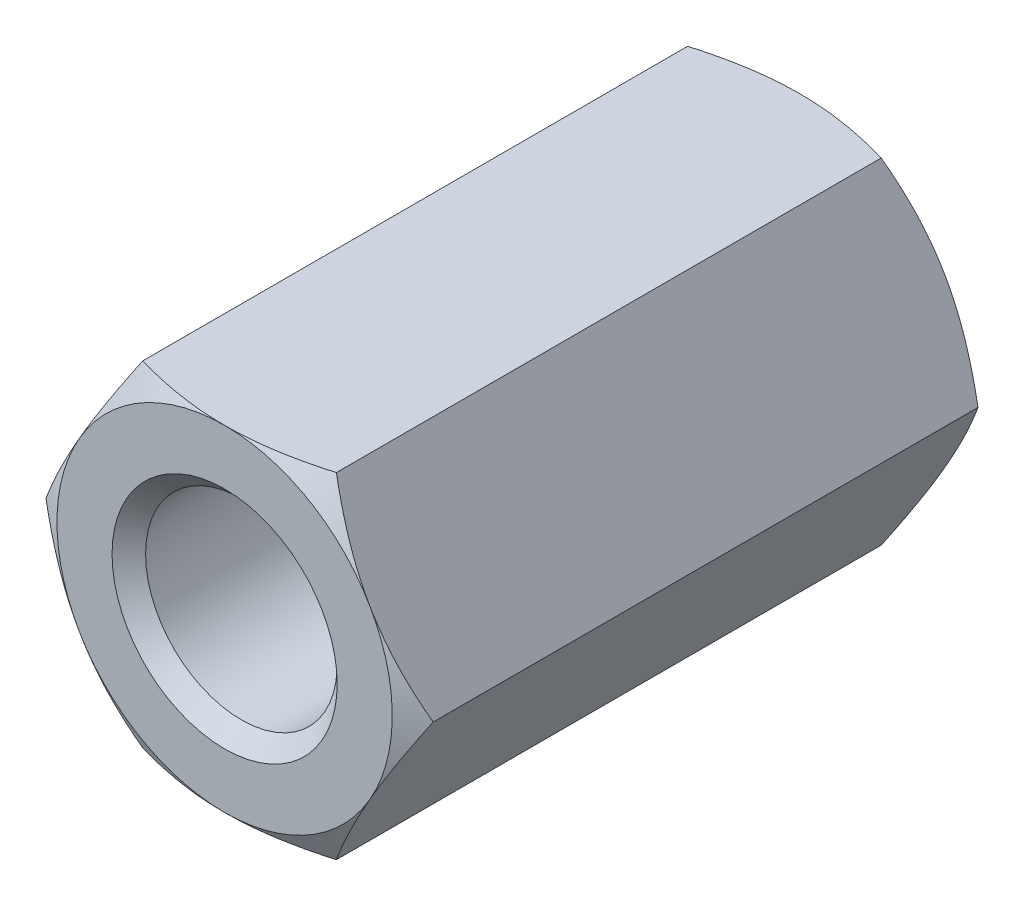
from build123d import *

# Parameters (mm, degrees)
BOSS_EXTRUDE1_DEPTH      = 6
SKETCH2_OUTSIDE_W        = 43.838
SKETCH2_OUTSIDE_H        = 42.756
SKETCH2_OUTSIDE_R        = 3.5
CUT_EXTRUDE1_DEPTH       = 9.036375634
CUT_EXTRUDE1_DRAFT       = -60
SKETCH3_R                = 2
SKETCH3_R_2              = 1.65
CUT_EXTRUDE2_DEPTH       = 6
SKETCH3_2_R              = 1.65
CUT_EXTRUDE3_DEPTH       = 7.05
CHAMFER1_SIZE            = 0.35
MIRROR1_COPY_1_SKETCH_W  = 43.838
MIRROR1_COPY_1_SKETCH_H  = 42.756
MIRROR1_COPY_1_SKETCH_R  = 3.5
MIRROR1_COPY_1_DEPTH     = 9.036375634
MIRROR1_COPY_1_DRAFT     = -60
CHAMFER1_OF_MIRROR1_SIZE = 0.35


with BuildPart() as part:
    # Sketch1 → Boss-Extrude1 (new body)
    with BuildSketch(Plane.XY):
        Polygon((2.020725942, 3.5), (-2.020725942, 3.5), (-4.041451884, 0), (-2.020725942, -3.5), (2.020725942, -3.5), (4.041451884, 0), align=None)
    boss_extrude1 = extrude(amount=-BOSS_EXTRUDE1_DEPTH)


with BuildPart() as cut_extrude1_tool:
    # Sketch2 outside → Cut-Extrude1 (with draft: the straight prism first)
    with BuildSketch(Plane(origin=(0, 0, -6), x_dir=(-1, 0, 0), z_dir=(0, 0, -1))):
        Rectangle(SKETCH2_OUTSIDE_W, SKETCH2_OUTSIDE_H)
        Circle(SKETCH2_OUTSIDE_R, mode=Mode.SUBTRACT)
    extrude(amount=-CUT_EXTRUDE1_DEPTH)
    # Cut-Extrude1: the draft: its side faces are tilted about the plane it starts from
    cut_extrude1_sides = [cut_extrude1_tool.faces().sort_by_distance(p)[0] for p in [
        (0, -21.378, -1.481812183),
        (-21.919, 0, -1.481812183),
        (0, 21.378, -1.481812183),
        (21.919, 0, -1.481812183),
        (3.5, 0, -1.481812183),
    ]]
    draft(cut_extrude1_sides, Plane(origin=(0, 0, -6), x_dir=(-1, 0, 0), z_dir=(0, 0, -1)), CUT_EXTRUDE1_DRAFT)


with BuildPart() as part_1:
    add(part.part)

    # Cut-Extrude1: cut by cut_extrude1_tool
    add(cut_extrude1_tool.part, mode=Mode.SUBTRACT)

    # Sketch3 → Cut-Extrude2 (cut)
    with BuildSketch(Plane(origin=(0, 0, -6), x_dir=(-1, 0, 0), z_dir=(0, 0, -1))):
        Circle(SKETCH3_R)
        Circle(SKETCH3_R_2, mode=Mode.SUBTRACT)
    cut_extrude2 = extrude(amount=-CUT_EXTRUDE2_DEPTH, mode=Mode.SUBTRACT)


with BuildPart() as cut_extrude2_piece_1:
    # of the separate pieces the step leaves, piece 1, a body of its own (cut_extrude2_pieces)
    add(part_1.part.solids().sort_by_distance((2.020725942, 3.5, 0))[0])

    # Chamfer1
    chamfer1_edges = [cut_extrude2_piece_1.edges().sort_by_distance(p)[0] for p in [
        (2, 0, -6),
    ]]
    chamfer(chamfer1_edges, length=CHAMFER1_SIZE)


with BuildPart() as cut_extrude2_piece_2:
    # of the separate pieces the step leaves, piece 2, a body of its own (cut_extrude2_pieces)
    add(part_1.part.solids().sort_by_distance((-1.65, 0, 0))[0])

    # Sketch3_2 → Cut-Extrude3 (cut)
    with BuildSketch(Plane(origin=(0, 0, -6), x_dir=(-1, 0, 0), z_dir=(0, 0, -1))):
        Circle(SKETCH3_2_R)
    cut_extrude3 = extrude(amount=-CUT_EXTRUDE3_DEPTH, mode=Mode.SUBTRACT)


with BuildPart() as cut_extrude2_piece_1_1:
    add(cut_extrude2_piece_1.part)

    # Mirror1: Boss-Extrude1, Cut-Extrude2, Cut-Extrude3 across plane
    add(boss_extrude1.mirror(Plane.XY))
    add(cut_extrude2.mirror(Plane.XY), mode=Mode.SUBTRACT)
    add(cut_extrude3.mirror(Plane.XY), mode=Mode.SUBTRACT)


with BuildPart() as mirror1_copy_1_tool:
    # Mirror1 copy 1 sketch → Mirror1 copy 1 (with draft: the straight prism first)
    with BuildSketch(Plane(origin=(0, 0, 6), x_dir=(-1, 0, 0), z_dir=(0, 0, 1))):
        Rectangle(MIRROR1_COPY_1_SKETCH_W, MIRROR1_COPY_1_SKETCH_H)
        Circle(MIRROR1_COPY_1_SKETCH_R, mode=Mode.SUBTRACT)
    extrude(amount=-MIRROR1_COPY_1_DEPTH)
    # Mirror1 copy 1: the draft: its side faces are tilted about the plane it starts from
    mirror1_copy_1_sides = [mirror1_copy_1_tool.faces().sort_by_distance(p)[0] for p in [
        (0, -21.378, 1.481812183),
        (-21.919, 0, 1.481812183),
        (0, 21.378, 1.481812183),
        (21.919, 0, 1.481812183),
        (3.5, 0, 1.481812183),
    ]]
    draft(mirror1_copy_1_sides, Plane(origin=(0, 0, 6), x_dir=(-1, 0, 0), z_dir=(0, 0, 1)), MIRROR1_COPY_1_DRAFT)


with BuildPart() as cut_extrude2_piece_1_2:
    add(cut_extrude2_piece_1_1.part)

    # Mirror1 copy 1: cut by mirror1_copy_1_tool
    add(mirror1_copy_1_tool.part, mode=Mode.SUBTRACT)

    # Chamfer1 of Mirror1
    chamfer1_of_mirror1_edges = [cut_extrude2_piece_1_2.edges().sort_by_distance(p)[0] for p in [
        (2, 0, 6),
    ]]
    chamfer(chamfer1_of_mirror1_edges, length=CHAMFER1_OF_MIRROR1_SIZE)


solid = cut_extrude2_piece_1_2.part
